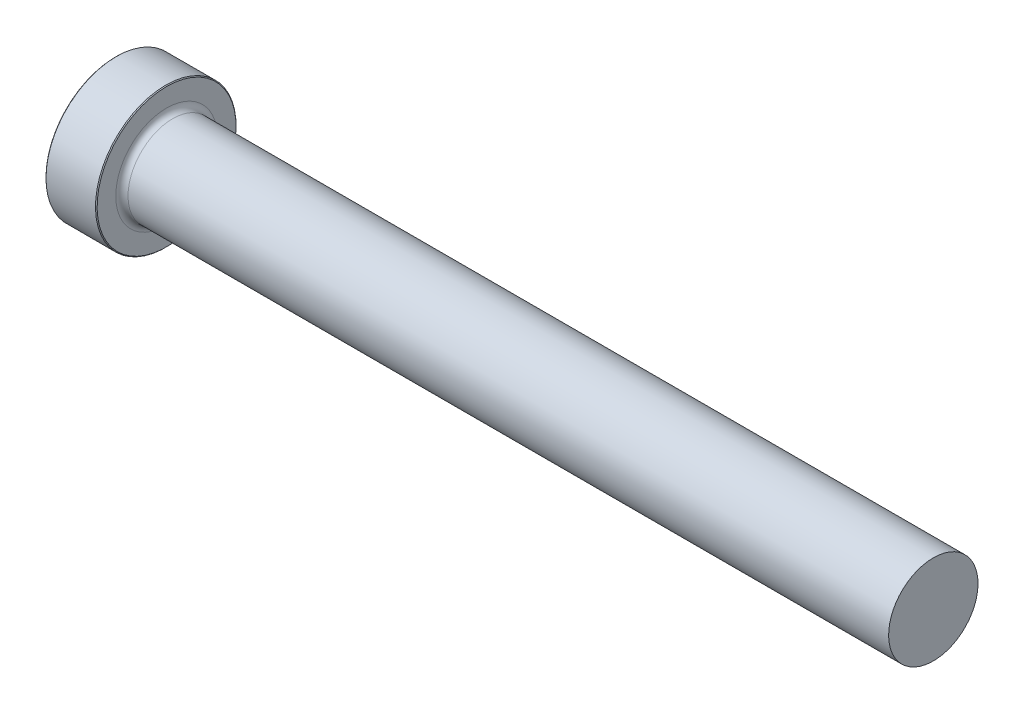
ISO-10303-21;
HEADER;
FILE_DESCRIPTION(('STEP AP214'),'2;1');
FILE_NAME('part.step','',(''),(''),'','','');
FILE_SCHEMA(('AUTOMOTIVE_DESIGN { 1 0 10303 214 1 1 1 1 }'));
ENDSEC;
DATA;
#1=APPLICATION_CONTEXT('core data for automotive mechanical design processes');
#2=APPLICATION_PROTOCOL_DEFINITION('international standard','automotive_design',2000,#1);
#3=PRODUCT_CONTEXT('',#1,'mechanical');
#4=PRODUCT('Part','Part','',(#3));
#5=PRODUCT_RELATED_PRODUCT_CATEGORY('part','',(#4));
#6=PRODUCT_DEFINITION_FORMATION('','',#4);
#7=PRODUCT_DEFINITION_CONTEXT('part definition',#1,'design');
#8=PRODUCT_DEFINITION('design','',#6,#7);
#9=PRODUCT_DEFINITION_SHAPE('','',#8);
#10=(LENGTH_UNIT() NAMED_UNIT(*) SI_UNIT(.MILLI.,.METRE.));
#11=(NAMED_UNIT(*) PLANE_ANGLE_UNIT() SI_UNIT($,.RADIAN.));
#12=(NAMED_UNIT(*) SI_UNIT($,.STERADIAN.) SOLID_ANGLE_UNIT());
#13=UNCERTAINTY_MEASURE_WITH_UNIT(LENGTH_MEASURE(1.E-05),#10,'distance_accuracy_value','');
#14=(GEOMETRIC_REPRESENTATION_CONTEXT(3) GLOBAL_UNCERTAINTY_ASSIGNED_CONTEXT((#13)) GLOBAL_UNIT_ASSIGNED_CONTEXT((#10,
#11,#12)) REPRESENTATION_CONTEXT('',''));
#15=CARTESIAN_POINT('',(0.,0.,0.));
#16=DIRECTION('',(0.,0.,1.));
#17=DIRECTION('',(1.,0.,0.));
#18=AXIS2_PLACEMENT_3D('',#15,#16,#17);
#19=CARTESIAN_POINT('',(101.6,5.55243999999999,0.));
#20=DIRECTION('',(1.,0.,0.));
#21=DIRECTION('',(0.,1.,0.));
#22=AXIS2_PLACEMENT_3D('',#19,#20,#21);
#23=PLANE('',#22);
#24=CARTESIAN_POINT('',(101.6,0.,0.));
#25=DIRECTION('',(1.,0.,0.));
#26=DIRECTION('',(0.,1.,0.));
#27=AXIS2_PLACEMENT_3D('',#24,#25,#26);
#28=CIRCLE('',#27,5.55244);
#29=CARTESIAN_POINT('',(101.6,5.55243999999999,0.));
#30=VERTEX_POINT('',#29);
#31=EDGE_CURVE('E50',#30,#30,#28,.T.);
#32=ORIENTED_EDGE('',*,*,#31,.T.);
#33=EDGE_LOOP('',(#32));
#34=FACE_BOUND('',#33,.T.);
#35=ADVANCED_FACE('F30',(#34),#23,.T.);
#36=CARTESIAN_POINT('',(101.6,0.,0.));
#37=DIRECTION('',(1.,0.,0.));
#38=DIRECTION('',(0.,1.,0.));
#39=AXIS2_PLACEMENT_3D('',#36,#37,#38);
#40=CYLINDRICAL_SURFACE('',#39,5.55244);
#41=CARTESIAN_POINT('',(7.11199999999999,0.,0.));
#42=DIRECTION('',(1.,0.,0.));
#43=DIRECTION('',(0.,1.,0.));
#44=AXIS2_PLACEMENT_3D('',#41,#42,#43);
#45=CIRCLE('',#44,5.55243999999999);
#46=CARTESIAN_POINT('',(7.11199999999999,5.55243999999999,0.));
#47=VERTEX_POINT('',#46);
#48=EDGE_CURVE('E53',#47,#47,#45,.T.);
#49=ORIENTED_EDGE('',*,*,#48,.T.);
#50=EDGE_LOOP('',(#49));
#51=FACE_BOUND('',#50,.T.);
#52=ORIENTED_EDGE('',*,*,#31,.F.);
#53=EDGE_LOOP('',(#52));
#54=FACE_BOUND('',#53,.T.);
#55=ADVANCED_FACE('F74',(#51,#54),#40,.T.);
#56=CARTESIAN_POINT('',(7.112,0.,0.));
#57=DIRECTION('',(1.,0.,0.));
#58=DIRECTION('',(0.,1.,0.));
#59=AXIS2_PLACEMENT_3D('',#56,#57,#58);
#60=TOROIDAL_SURFACE('',#59,6.31443999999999,0.762);
#61=CARTESIAN_POINT('',(6.34999999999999,0.,0.));
#62=DIRECTION('',(1.,0.,0.));
#63=DIRECTION('',(0.,1.,0.));
#64=AXIS2_PLACEMENT_3D('',#61,#62,#63);
#65=CIRCLE('',#64,6.31443999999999);
#66=CARTESIAN_POINT('',(6.34999999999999,6.31443999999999,0.));
#67=VERTEX_POINT('',#66);
#68=EDGE_CURVE('E56',#67,#67,#65,.T.);
#69=ORIENTED_EDGE('',*,*,#68,.T.);
#70=EDGE_LOOP('',(#69));
#71=FACE_BOUND('',#70,.T.);
#72=ORIENTED_EDGE('',*,*,#48,.F.);
#73=EDGE_LOOP('',(#72));
#74=FACE_BOUND('',#73,.T.);
#75=ADVANCED_FACE('F60',(#71,#74),#60,.F.);
#76=CARTESIAN_POINT('',(6.35,8.73125,0.));
#77=DIRECTION('',(1.,0.,0.));
#78=DIRECTION('',(0.,1.,0.));
#79=AXIS2_PLACEMENT_3D('',#76,#77,#78);
#80=PLANE('',#79);
#81=CARTESIAN_POINT('',(6.35,0.,0.));
#82=DIRECTION('',(1.,0.,0.));
#83=DIRECTION('',(0.,1.,0.));
#84=AXIS2_PLACEMENT_3D('',#81,#82,#83);
#85=CIRCLE('',#84,8.62964999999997);
#86=CARTESIAN_POINT('',(6.35,8.62964999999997,0.));
#87=VERTEX_POINT('',#86);
#88=EDGE_CURVE('E10',#87,#87,#85,.T.);
#89=ORIENTED_EDGE('',*,*,#88,.T.);
#90=EDGE_LOOP('',(#89));
#91=FACE_BOUND('',#90,.T.);
#92=ORIENTED_EDGE('',*,*,#68,.F.);
#93=EDGE_LOOP('',(#92));
#94=FACE_BOUND('',#93,.T.);
#95=ADVANCED_FACE('F63',(#91,#94),#80,.T.);
#96=CARTESIAN_POINT('',(101.6,0.,0.));
#97=DIRECTION('',(1.,0.,0.));
#98=DIRECTION('',(0.,1.,0.));
#99=AXIS2_PLACEMENT_3D('',#96,#97,#98);
#100=CYLINDRICAL_SURFACE('',#99,8.73125);
#101=CARTESIAN_POINT('',(0.101600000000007,0.,0.));
#102=DIRECTION('',(-1.,0.,0.));
#103=DIRECTION('',(0.,-1.,0.));
#104=AXIS2_PLACEMENT_3D('',#101,#102,#103);
#105=CIRCLE('',#104,8.73125);
#106=CARTESIAN_POINT('',(0.101600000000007,-8.73125,0.));
#107=VERTEX_POINT('',#106);
#108=EDGE_CURVE('E41',#107,#107,#105,.F.);
#109=ORIENTED_EDGE('',*,*,#108,.T.);
#110=EDGE_LOOP('',(#109));
#111=FACE_BOUND('',#110,.T.);
#112=CARTESIAN_POINT('',(6.24839999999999,0.,0.));
#113=DIRECTION('',(1.,0.,0.));
#114=DIRECTION('',(0.,1.,0.));
#115=AXIS2_PLACEMENT_3D('',#112,#113,#114);
#116=CIRCLE('',#115,8.73125);
#117=CARTESIAN_POINT('',(6.24839999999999,8.73125,0.));
#118=VERTEX_POINT('',#117);
#119=EDGE_CURVE('E45',#118,#118,#116,.F.);
#120=ORIENTED_EDGE('',*,*,#119,.T.);
#121=EDGE_LOOP('',(#120));
#122=FACE_BOUND('',#121,.T.);
#123=ADVANCED_FACE('F65',(#111,#122),#100,.T.);
#124=CARTESIAN_POINT('',(0.,0.,0.));
#125=DIRECTION('',(-1.,0.,0.));
#126=DIRECTION('',(0.,-1.,0.));
#127=AXIS2_PLACEMENT_3D('',#124,#125,#126);
#128=PLANE('',#127);
#129=CARTESIAN_POINT('',(0.,0.,0.));
#130=DIRECTION('',(-1.,0.,0.));
#131=DIRECTION('',(0.,-1.,0.));
#132=AXIS2_PLACEMENT_3D('',#129,#130,#131);
#133=CIRCLE('',#132,8.62964999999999);
#134=CARTESIAN_POINT('',(0.,-8.62964999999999,0.));
#135=VERTEX_POINT('',#134);
#136=EDGE_CURVE('E37',#135,#135,#133,.T.);
#137=ORIENTED_EDGE('',*,*,#136,.T.);
#138=EDGE_LOOP('',(#137));
#139=FACE_BOUND('',#138,.T.);
#140=ADVANCED_FACE('F71',(#139),#128,.T.);
#141=CARTESIAN_POINT('',(0.101600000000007,0.,0.));
#142=DIRECTION('',(1.,0.,0.));
#143=DIRECTION('',(0.,1.,0.));
#144=AXIS2_PLACEMENT_3D('',#141,#142,#143);
#145=CONICAL_SURFACE('',#144,8.73125,0.785398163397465);
#146=ORIENTED_EDGE('',*,*,#136,.F.);
#147=EDGE_LOOP('',(#146));
#148=FACE_BOUND('',#147,.T.);
#149=ORIENTED_EDGE('',*,*,#108,.F.);
#150=EDGE_LOOP('',(#149));
#151=FACE_BOUND('',#150,.T.);
#152=ADVANCED_FACE('F84',(#148,#151),#145,.T.);
#153=CARTESIAN_POINT('',(6.34999999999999,0.,0.));
#154=DIRECTION('',(-1.,0.,0.));
#155=DIRECTION('',(0.,-1.,0.));
#156=AXIS2_PLACEMENT_3D('',#153,#154,#155);
#157=CONICAL_SURFACE('',#156,8.62964999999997,0.785398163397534);
#158=ORIENTED_EDGE('',*,*,#119,.F.);
#159=EDGE_LOOP('',(#158));
#160=FACE_BOUND('',#159,.T.);
#161=ORIENTED_EDGE('',*,*,#88,.F.);
#162=EDGE_LOOP('',(#161));
#163=FACE_BOUND('',#162,.T.);
#164=ADVANCED_FACE('F32',(#160,#163),#157,.T.);
#165=CLOSED_SHELL('',(#35,#55,#75,#95,#123,#140,#152,#164));
#166=MANIFOLD_SOLID_BREP('B2',#165);
#167=ADVANCED_BREP_SHAPE_REPRESENTATION('',(#18,#166),#14);
#168=SHAPE_DEFINITION_REPRESENTATION(#9,#167);
ENDSEC;
END-ISO-10303-21;
